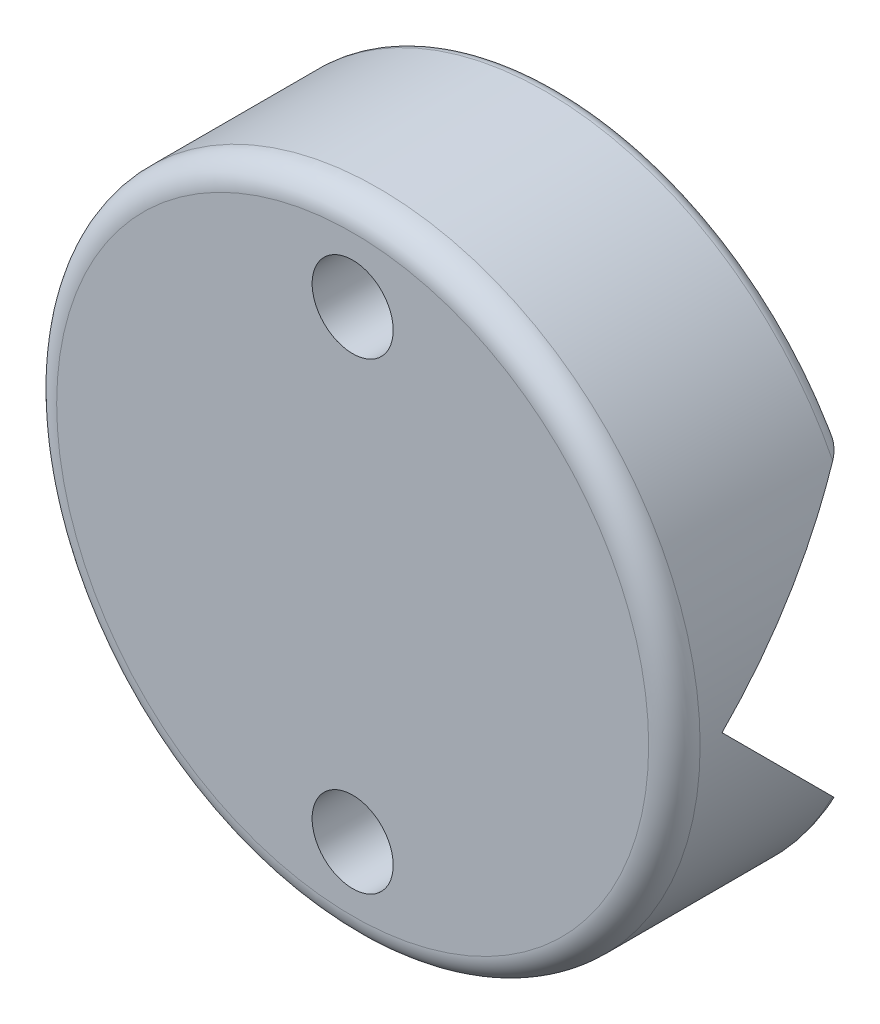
ISO-10303-21;
HEADER;
FILE_DESCRIPTION(('STEP AP214'),'2;1');
FILE_NAME('part.step','',(''),(''),'','','');
FILE_SCHEMA(('AUTOMOTIVE_DESIGN { 1 0 10303 214 1 1 1 1 }'));
ENDSEC;
DATA;
#1=APPLICATION_CONTEXT('core data for automotive mechanical design processes');
#2=APPLICATION_PROTOCOL_DEFINITION('international standard','automotive_design',2000,#1);
#3=PRODUCT_CONTEXT('',#1,'mechanical');
#4=PRODUCT('Part','Part','',(#3));
#5=PRODUCT_RELATED_PRODUCT_CATEGORY('part','',(#4));
#6=PRODUCT_DEFINITION_FORMATION('','',#4);
#7=PRODUCT_DEFINITION_CONTEXT('part definition',#1,'design');
#8=PRODUCT_DEFINITION('design','',#6,#7);
#9=PRODUCT_DEFINITION_SHAPE('','',#8);
#10=(LENGTH_UNIT() NAMED_UNIT(*) SI_UNIT(.MILLI.,.METRE.));
#11=(NAMED_UNIT(*) PLANE_ANGLE_UNIT() SI_UNIT($,.RADIAN.));
#12=(NAMED_UNIT(*) SI_UNIT($,.STERADIAN.) SOLID_ANGLE_UNIT());
#13=UNCERTAINTY_MEASURE_WITH_UNIT(LENGTH_MEASURE(1.E-05),#10,'distance_accuracy_value','');
#14=(GEOMETRIC_REPRESENTATION_CONTEXT(3) GLOBAL_UNCERTAINTY_ASSIGNED_CONTEXT((#13)) GLOBAL_UNIT_ASSIGNED_CONTEXT((#10,
#11,#12)) REPRESENTATION_CONTEXT('',''));
#15=CARTESIAN_POINT('',(0.,0.,0.));
#16=DIRECTION('',(0.,0.,1.));
#17=DIRECTION('',(1.,0.,0.));
#18=AXIS2_PLACEMENT_3D('',#15,#16,#17);
#19=CARTESIAN_POINT('',(0.,0.,0.));
#20=DIRECTION('',(0.,0.,1.));
#21=DIRECTION('',(1.,0.,0.));
#22=AXIS2_PLACEMENT_3D('',#19,#20,#21);
#23=PLANE('',#22);
#24=CARTESIAN_POINT('',(0.,18.,0.));
#25=DIRECTION('',(0.,0.,1.));
#26=DIRECTION('',(1.,0.,0.));
#27=AXIS2_PLACEMENT_3D('',#24,#25,#26);
#28=CIRCLE('',#27,3.15);
#29=CARTESIAN_POINT('',(3.15,18.,0.));
#30=VERTEX_POINT('',#29);
#31=EDGE_CURVE('E113',#30,#30,#28,.T.);
#32=ORIENTED_EDGE('',*,*,#31,.T.);
#33=EDGE_LOOP('',(#32));
#34=FACE_BOUND('',#33,.T.);
#35=DIRECTION('',(-1.,0.,0.));
#36=VECTOR('',#35,1.);
#37=CARTESIAN_POINT('',(0.,12.3,0.));
#38=LINE('',#37,#36);
#39=CARTESIAN_POINT('',(20.6084933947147,12.3,0.));
#40=VERTEX_POINT('',#39);
#41=CARTESIAN_POINT('',(-20.6084933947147,12.3,0.));
#42=VERTEX_POINT('',#41);
#43=EDGE_CURVE('E116',#40,#42,#38,.T.);
#44=ORIENTED_EDGE('',*,*,#43,.T.);
#45=CARTESIAN_POINT('',(0.,0.,0.));
#46=DIRECTION('',(0.,0.,1.));
#47=DIRECTION('',(1.,0.,0.));
#48=AXIS2_PLACEMENT_3D('',#45,#46,#47);
#49=CIRCLE('',#48,24.);
#50=EDGE_CURVE('E233',#42,#40,#49,.F.);
#51=ORIENTED_EDGE('',*,*,#50,.T.);
#52=EDGE_LOOP('',(#44,#51));
#53=FACE_BOUND('',#52,.T.);
#54=ADVANCED_FACE('F33',(#34,#53),#23,.F.);
#55=CARTESIAN_POINT('',(0.,0.,16.));
#56=DIRECTION('',(0.,0.,-1.));
#57=DIRECTION('',(-1.,0.,0.));
#58=AXIS2_PLACEMENT_3D('',#55,#56,#57);
#59=CYLINDRICAL_SURFACE('',#58,25.);
#60=CARTESIAN_POINT('',(0.,0.,14.));
#61=DIRECTION('',(0.,0.,1.));
#62=DIRECTION('',(1.,0.,0.));
#63=AXIS2_PLACEMENT_3D('',#60,#61,#62);
#64=CIRCLE('',#63,25.);
#65=CARTESIAN_POINT('',(25.,0.,14.));
#66=VERTEX_POINT('',#65);
#67=EDGE_CURVE('E124',#66,#66,#64,.F.);
#68=ORIENTED_EDGE('',*,*,#67,.T.);
#69=EDGE_LOOP('',(#68));
#70=FACE_BOUND('',#69,.T.);
#71=CARTESIAN_POINT('',(0.,0.,12.3));
#72=DIRECTION('',(0.,0.707106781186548,0.707106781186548));
#73=DIRECTION('',(0.,0.707106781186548,-0.707106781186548));
#74=AXIS2_PLACEMENT_3D('',#71,#72,#73);
#75=ELLIPSE('',#74,35.3553390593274,25.);
#76=CARTESIAN_POINT('',(25.,0.,12.3));
#77=VERTEX_POINT('',#76);
#78=CARTESIAN_POINT('',(22.3004484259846,11.3,1.));
#79=VERTEX_POINT('',#78);
#80=EDGE_CURVE('E81',#77,#79,#75,.T.);
#81=ORIENTED_EDGE('',*,*,#80,.T.);
#82=CARTESIAN_POINT('',(0.,0.,1.));
#83=DIRECTION('',(0.,0.,1.));
#84=DIRECTION('',(1.,0.,0.));
#85=AXIS2_PLACEMENT_3D('',#82,#83,#84);
#86=CIRCLE('',#85,25.);
#87=CARTESIAN_POINT('',(-22.3004484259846,11.3,1.));
#88=VERTEX_POINT('',#87);
#89=EDGE_CURVE('E128',#79,#88,#86,.T.);
#90=ORIENTED_EDGE('',*,*,#89,.T.);
#91=CARTESIAN_POINT('',(0.,0.,12.3));
#92=DIRECTION('',(0.,0.707106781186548,0.707106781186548));
#93=DIRECTION('',(0.,0.707106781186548,-0.707106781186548));
#94=AXIS2_PLACEMENT_3D('',#91,#92,#93);
#95=ELLIPSE('',#94,35.3553390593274,25.);
#96=CARTESIAN_POINT('',(-25.,0.,12.3));
#97=VERTEX_POINT('',#96);
#98=EDGE_CURVE('E94',#88,#97,#95,.T.);
#99=ORIENTED_EDGE('',*,*,#98,.T.);
#100=CARTESIAN_POINT('',(0.,0.,12.3));
#101=DIRECTION('',(0.,-0.707106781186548,0.707106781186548));
#102=DIRECTION('',(0.,-0.707106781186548,-0.707106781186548));
#103=AXIS2_PLACEMENT_3D('',#100,#101,#102);
#104=ELLIPSE('',#103,35.3553390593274,25.);
#105=CARTESIAN_POINT('',(-22.3004484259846,-11.3,1.));
#106=VERTEX_POINT('',#105);
#107=EDGE_CURVE('E91',#97,#106,#104,.T.);
#108=ORIENTED_EDGE('',*,*,#107,.T.);
#109=CARTESIAN_POINT('',(0.,0.,1.));
#110=DIRECTION('',(0.,0.,1.));
#111=DIRECTION('',(1.,0.,0.));
#112=AXIS2_PLACEMENT_3D('',#109,#110,#111);
#113=CIRCLE('',#112,25.);
#114=CARTESIAN_POINT('',(22.3004484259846,-11.3,1.));
#115=VERTEX_POINT('',#114);
#116=EDGE_CURVE('E85',#106,#115,#113,.T.);
#117=ORIENTED_EDGE('',*,*,#116,.T.);
#118=CARTESIAN_POINT('',(0.,0.,12.3));
#119=DIRECTION('',(0.,-0.707106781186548,0.707106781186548));
#120=DIRECTION('',(0.,-0.707106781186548,-0.707106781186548));
#121=AXIS2_PLACEMENT_3D('',#118,#119,#120);
#122=ELLIPSE('',#121,35.3553390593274,25.);
#123=EDGE_CURVE('E77',#115,#77,#122,.T.);
#124=ORIENTED_EDGE('',*,*,#123,.T.);
#125=EDGE_LOOP('',(#81,#90,#99,#108,#117,#124));
#126=FACE_BOUND('',#125,.T.);
#127=ADVANCED_FACE('F35',(#70,#126),#59,.T.);
#128=CARTESIAN_POINT('',(0.,0.,16.));
#129=DIRECTION('',(0.,0.,1.));
#130=DIRECTION('',(1.,0.,0.));
#131=AXIS2_PLACEMENT_3D('',#128,#129,#130);
#132=PLANE('',#131);
#133=CARTESIAN_POINT('',(0.,0.,16.));
#134=DIRECTION('',(0.,0.,1.));
#135=DIRECTION('',(1.,0.,0.));
#136=AXIS2_PLACEMENT_3D('',#133,#134,#135);
#137=CIRCLE('',#136,23.);
#138=CARTESIAN_POINT('',(23.,0.,16.));
#139=VERTEX_POINT('',#138);
#140=EDGE_CURVE('E121',#139,#139,#137,.T.);
#141=ORIENTED_EDGE('',*,*,#140,.T.);
#142=EDGE_LOOP('',(#141));
#143=FACE_BOUND('',#142,.T.);
#144=CARTESIAN_POINT('',(0.,-18.,16.));
#145=DIRECTION('',(0.,0.,1.));
#146=DIRECTION('',(1.,0.,0.));
#147=AXIS2_PLACEMENT_3D('',#144,#145,#146);
#148=CIRCLE('',#147,3.15);
#149=CARTESIAN_POINT('',(3.15,-18.,16.));
#150=VERTEX_POINT('',#149);
#151=EDGE_CURVE('E104',#150,#150,#148,.T.);
#152=ORIENTED_EDGE('',*,*,#151,.F.);
#153=EDGE_LOOP('',(#152));
#154=FACE_BOUND('',#153,.T.);
#155=CARTESIAN_POINT('',(0.,18.,16.));
#156=DIRECTION('',(0.,0.,1.));
#157=DIRECTION('',(1.,0.,0.));
#158=AXIS2_PLACEMENT_3D('',#155,#156,#157);
#159=CIRCLE('',#158,3.15);
#160=CARTESIAN_POINT('',(3.15,18.,16.));
#161=VERTEX_POINT('',#160);
#162=EDGE_CURVE('E110',#161,#161,#159,.T.);
#163=ORIENTED_EDGE('',*,*,#162,.F.);
#164=EDGE_LOOP('',(#163));
#165=FACE_BOUND('',#164,.T.);
#166=ADVANCED_FACE('F186',(#143,#154,#165),#132,.T.);
#167=DIRECTION('',(1.,0.,0.));
#168=VECTOR('',#167,1.);
#169=CARTESIAN_POINT('',(0.,-12.3,0.));
#170=LINE('',#169,#168);
#171=CARTESIAN_POINT('',(-20.6084933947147,-12.3,0.));
#172=VERTEX_POINT('',#171);
#173=CARTESIAN_POINT('',(20.6084933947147,-12.3,0.));
#174=VERTEX_POINT('',#173);
#175=EDGE_CURVE('E119',#172,#174,#170,.T.);
#176=ORIENTED_EDGE('',*,*,#175,.T.);
#177=CARTESIAN_POINT('',(0.,0.,0.));
#178=DIRECTION('',(0.,0.,1.));
#179=DIRECTION('',(1.,0.,0.));
#180=AXIS2_PLACEMENT_3D('',#177,#178,#179);
#181=CIRCLE('',#180,24.);
#182=EDGE_CURVE('E11',#174,#172,#181,.F.);
#183=ORIENTED_EDGE('',*,*,#182,.T.);
#184=EDGE_LOOP('',(#176,#183));
#185=FACE_BOUND('',#184,.T.);
#186=CARTESIAN_POINT('',(0.,-18.,0.));
#187=DIRECTION('',(0.,0.,1.));
#188=DIRECTION('',(1.,0.,0.));
#189=AXIS2_PLACEMENT_3D('',#186,#187,#188);
#190=CIRCLE('',#189,3.15);
#191=CARTESIAN_POINT('',(3.15,-18.,0.));
#192=VERTEX_POINT('',#191);
#193=EDGE_CURVE('E107',#192,#192,#190,.T.);
#194=ORIENTED_EDGE('',*,*,#193,.T.);
#195=EDGE_LOOP('',(#194));
#196=FACE_BOUND('',#195,.T.);
#197=ADVANCED_FACE('F181',(#185,#196),#23,.F.);
#198=CARTESIAN_POINT('',(0.,18.,0.));
#199=DIRECTION('',(0.,0.,1.));
#200=DIRECTION('',(1.,0.,0.));
#201=AXIS2_PLACEMENT_3D('',#198,#199,#200);
#202=CYLINDRICAL_SURFACE('',#201,3.15);
#203=ORIENTED_EDGE('',*,*,#31,.F.);
#204=EDGE_LOOP('',(#203));
#205=FACE_BOUND('',#204,.T.);
#206=ORIENTED_EDGE('',*,*,#162,.T.);
#207=EDGE_LOOP('',(#206));
#208=FACE_BOUND('',#207,.T.);
#209=ADVANCED_FACE('F190',(#205,#208),#202,.F.);
#210=CARTESIAN_POINT('',(0.,-18.,0.));
#211=DIRECTION('',(0.,0.,1.));
#212=DIRECTION('',(1.,0.,0.));
#213=AXIS2_PLACEMENT_3D('',#210,#211,#212);
#214=CYLINDRICAL_SURFACE('',#213,3.15);
#215=ORIENTED_EDGE('',*,*,#193,.F.);
#216=EDGE_LOOP('',(#215));
#217=FACE_BOUND('',#216,.T.);
#218=ORIENTED_EDGE('',*,*,#151,.T.);
#219=EDGE_LOOP('',(#218));
#220=FACE_BOUND('',#219,.T.);
#221=ADVANCED_FACE('F155',(#217,#220),#214,.F.);
#222=CARTESIAN_POINT('',(-25.,-12.3,0.));
#223=DIRECTION('',(0.,-0.707106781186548,0.707106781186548));
#224=DIRECTION('',(0.,-0.707106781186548,-0.707106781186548));
#225=AXIS2_PLACEMENT_3D('',#222,#223,#224);
#226=PLANE('',#225);
#227=ORIENTED_EDGE('',*,*,#123,.F.);
#228=CARTESIAN_POINT('',(22.3004484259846,-11.3,1.));
#229=CARTESIAN_POINT('',(22.2792794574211,-11.3417313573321,0.958268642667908));
#230=CARTESIAN_POINT('',(22.2554382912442,-11.3827586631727,0.917241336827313));
#231=CARTESIAN_POINT('',(22.2029044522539,-11.4632001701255,0.836799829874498));
#232=CARTESIAN_POINT('',(22.1742150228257,-11.5026154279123,0.797384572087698));
#233=CARTESIAN_POINT('',(22.1123780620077,-11.5797712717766,0.720228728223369));
#234=CARTESIAN_POINT('',(22.0792205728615,-11.6175078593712,0.682492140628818));
#235=CARTESIAN_POINT('',(22.0088472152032,-11.6910286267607,0.608971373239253));
#236=CARTESIAN_POINT('',(21.9716305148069,-11.726812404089,0.573187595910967));
#237=CARTESIAN_POINT('',(21.8524415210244,-11.8326108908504,0.467389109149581));
#238=CARTESIAN_POINT('',(21.7643542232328,-11.8993041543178,0.400695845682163));
#239=CARTESIAN_POINT('',(21.6216625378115,-11.9909746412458,0.309025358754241));
#240=CARTESIAN_POINT('',(21.5723084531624,-12.0201503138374,0.279849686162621));
#241=CARTESIAN_POINT('',(21.4701858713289,-12.0753388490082,0.224661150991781));
#242=CARTESIAN_POINT('',(21.4174189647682,-12.1013531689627,0.198646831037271));
#243=CARTESIAN_POINT('',(21.2944308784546,-12.1560274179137,0.143972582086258));
#244=CARTESIAN_POINT('',(21.2232415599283,-12.1836134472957,0.116386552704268));
#245=CARTESIAN_POINT('',(21.0763898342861,-12.2314047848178,0.0685952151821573));
#246=CARTESIAN_POINT('',(21.0007526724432,-12.2516478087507,0.0483521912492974));
#247=CARTESIAN_POINT('',(20.8721888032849,-12.2773725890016,0.0226274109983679));
#248=CARTESIAN_POINT('',(20.8203561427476,-12.2855354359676,0.0144645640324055));
#249=CARTESIAN_POINT('',(20.7152607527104,-12.2968435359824,0.00315646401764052));
#250=CARTESIAN_POINT('',(20.6619904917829,-12.2999528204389,4.71795611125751E-05));
#251=CARTESIAN_POINT('',(20.6084933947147,-12.3,0.));
#252=B_SPLINE_CURVE_WITH_KNOTS('',3,(#228,#229,#230,#231,#232,#233,#234,#235,#236,#237,#238,
#239,#240,#241,#242,#243,#244,#245,#246,#247,#248,#249,#250,#251),.UNSPECIFIED.,.F.,.F.,(4,2,2,
2,2,2,2,2,2,2,2,4),(0.,0.187979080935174,0.375832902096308,0.564112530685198,0.752430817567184,
1.13761593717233,1.33042077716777,1.52313639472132,1.76601452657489,2.00762688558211,
2.16648978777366,2.3264785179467),.UNSPECIFIED.);
#253=EDGE_CURVE('E41',#115,#174,#252,.T.);
#254=ORIENTED_EDGE('',*,*,#253,.T.);
#255=ORIENTED_EDGE('',*,*,#175,.F.);
#256=CARTESIAN_POINT('',(-20.6084933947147,-12.3,0.));
#257=CARTESIAN_POINT('',(-20.64462855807,-12.299990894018,9.10598200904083E-06));
#258=CARTESIAN_POINT('',(-20.680703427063,-12.298557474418,0.00144252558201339));
#259=CARTESIAN_POINT('',(-20.7523937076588,-12.2931911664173,0.00680883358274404));
#260=CARTESIAN_POINT('',(-20.7880100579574,-12.2892646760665,0.0107353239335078));
#261=CARTESIAN_POINT('',(-20.8931675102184,-12.2743642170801,0.0256357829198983));
#262=CARTESIAN_POINT('',(-20.9618186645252,-12.2602534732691,0.0397465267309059));
#263=CARTESIAN_POINT('',(-21.1238451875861,-12.2182691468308,0.0817308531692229));
#264=CARTESIAN_POINT('',(-21.2154724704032,-12.1871030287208,0.11289697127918));
#265=CARTESIAN_POINT('',(-21.3912765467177,-12.1149583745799,0.185041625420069));
#266=CARTESIAN_POINT('',(-21.4753950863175,-12.0739109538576,0.226089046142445));
#267=CARTESIAN_POINT('',(-21.6599560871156,-11.9700996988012,0.329900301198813));
#268=CARTESIAN_POINT('',(-21.7572772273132,-11.9045588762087,0.395441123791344));
#269=CARTESIAN_POINT('',(-21.935161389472,-11.7633410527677,0.536658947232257));
#270=CARTESIAN_POINT('',(-22.0157741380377,-11.6876952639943,0.612304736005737));
#271=CARTESIAN_POINT('',(-22.1300822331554,-11.5594054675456,0.740594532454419));
#272=CARTESIAN_POINT('',(-22.169767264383,-11.5094013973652,0.790598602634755));
#273=CARTESIAN_POINT('',(-22.2233999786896,-11.4323538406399,0.867646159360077));
#274=CARTESIAN_POINT('',(-22.2402958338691,-11.4063296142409,0.893670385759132));
#275=CARTESIAN_POINT('',(-22.2719868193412,-11.353635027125,0.946364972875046));
#276=CARTESIAN_POINT('',(-22.2867809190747,-11.326964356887,0.973035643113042));
#277=CARTESIAN_POINT('',(-22.3004484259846,-11.3,1.));
#278=B_SPLINE_CURVE_WITH_KNOTS('',3,(#256,#257,#258,#259,#260,#261,#262,#263,#264,#265,#266,
#267,#268,#269,#270,#271,#272,#273,#274,#275,#276,#277),.UNSPECIFIED.,.F.,.F.,(4,2,2,2,2,2,2,2,
2,2,4),(0.,0.108258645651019,0.216240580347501,0.429834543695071,0.733281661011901,
1.03890876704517,1.44011045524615,1.84010039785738,2.08293576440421,2.20436660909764,
2.32585679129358),.UNSPECIFIED.);
#279=EDGE_CURVE('E159',#172,#106,#278,.T.);
#280=ORIENTED_EDGE('',*,*,#279,.T.);
#281=ORIENTED_EDGE('',*,*,#107,.F.);
#282=DIRECTION('',(1.,0.,0.));
#283=VECTOR('',#282,1.);
#284=CARTESIAN_POINT('',(-25.,0.,12.3));
#285=LINE('',#284,#283);
#286=EDGE_CURVE('E89',#97,#77,#285,.T.);
#287=ORIENTED_EDGE('',*,*,#286,.T.);
#288=EDGE_LOOP('',(#227,#254,#255,#280,#281,#287));
#289=FACE_BOUND('',#288,.T.);
#290=ADVANCED_FACE('F90',(#289),#226,.F.);
#291=CARTESIAN_POINT('',(-25.,12.3,0.));
#292=DIRECTION('',(0.,0.707106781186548,0.707106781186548));
#293=DIRECTION('',(0.,-0.707106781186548,0.707106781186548));
#294=AXIS2_PLACEMENT_3D('',#291,#292,#293);
#295=PLANE('',#294);
#296=ORIENTED_EDGE('',*,*,#98,.F.);
#297=CARTESIAN_POINT('',(-22.3004484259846,11.3,1.));
#298=CARTESIAN_POINT('',(-22.2792794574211,11.3417313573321,0.958268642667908));
#299=CARTESIAN_POINT('',(-22.2554382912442,11.3827586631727,0.917241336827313));
#300=CARTESIAN_POINT('',(-22.2029044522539,11.4632001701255,0.836799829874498));
#301=CARTESIAN_POINT('',(-22.1742150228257,11.5026154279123,0.797384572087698));
#302=CARTESIAN_POINT('',(-22.1123780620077,11.5797712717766,0.720228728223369));
#303=CARTESIAN_POINT('',(-22.0792205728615,11.6175078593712,0.682492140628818));
#304=CARTESIAN_POINT('',(-22.0088472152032,11.6910286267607,0.608971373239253));
#305=CARTESIAN_POINT('',(-21.9716305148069,11.726812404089,0.573187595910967));
#306=CARTESIAN_POINT('',(-21.8524415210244,11.8326108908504,0.467389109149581));
#307=CARTESIAN_POINT('',(-21.7643542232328,11.8993041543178,0.400695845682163));
#308=CARTESIAN_POINT('',(-21.6216625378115,11.9909746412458,0.309025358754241));
#309=CARTESIAN_POINT('',(-21.5723084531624,12.0201503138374,0.279849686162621));
#310=CARTESIAN_POINT('',(-21.4701858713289,12.0753388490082,0.224661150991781));
#311=CARTESIAN_POINT('',(-21.4174189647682,12.1013531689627,0.198646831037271));
#312=CARTESIAN_POINT('',(-21.2944308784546,12.1560274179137,0.143972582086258));
#313=CARTESIAN_POINT('',(-21.2232415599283,12.1836134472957,0.116386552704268));
#314=CARTESIAN_POINT('',(-21.0763898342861,12.2314047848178,0.0685952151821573));
#315=CARTESIAN_POINT('',(-21.0007526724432,12.2516478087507,0.0483521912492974));
#316=CARTESIAN_POINT('',(-20.8721888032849,12.2773725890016,0.0226274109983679));
#317=CARTESIAN_POINT('',(-20.8203561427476,12.2855354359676,0.0144645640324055));
#318=CARTESIAN_POINT('',(-20.7152607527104,12.2968435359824,0.00315646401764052));
#319=CARTESIAN_POINT('',(-20.6619904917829,12.2999528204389,4.71795611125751E-05));
#320=CARTESIAN_POINT('',(-20.6084933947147,12.3,0.));
#321=B_SPLINE_CURVE_WITH_KNOTS('',3,(#297,#298,#299,#300,#301,#302,#303,#304,#305,#306,#307,
#308,#309,#310,#311,#312,#313,#314,#315,#316,#317,#318,#319,#320),.UNSPECIFIED.,.F.,.F.,(4,2,2,
2,2,2,2,2,2,2,2,4),(0.,0.187979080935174,0.375832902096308,0.564112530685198,0.752430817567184,
1.13761593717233,1.33042077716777,1.52313639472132,1.76601452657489,2.00762688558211,
2.16648978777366,2.3264785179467),.UNSPECIFIED.);
#322=EDGE_CURVE('E137',#88,#42,#321,.T.);
#323=ORIENTED_EDGE('',*,*,#322,.T.);
#324=ORIENTED_EDGE('',*,*,#43,.F.);
#325=CARTESIAN_POINT('',(20.6084933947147,12.3,0.));
#326=CARTESIAN_POINT('',(20.64462855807,12.299990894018,9.10598200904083E-06));
#327=CARTESIAN_POINT('',(20.680703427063,12.298557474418,0.00144252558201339));
#328=CARTESIAN_POINT('',(20.7523937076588,12.2931911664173,0.00680883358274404));
#329=CARTESIAN_POINT('',(20.7880100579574,12.2892646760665,0.0107353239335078));
#330=CARTESIAN_POINT('',(20.8931675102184,12.2743642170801,0.0256357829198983));
#331=CARTESIAN_POINT('',(20.9618186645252,12.2602534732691,0.0397465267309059));
#332=CARTESIAN_POINT('',(21.1238451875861,12.2182691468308,0.0817308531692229));
#333=CARTESIAN_POINT('',(21.2154724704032,12.1871030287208,0.11289697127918));
#334=CARTESIAN_POINT('',(21.3912765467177,12.1149583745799,0.185041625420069));
#335=CARTESIAN_POINT('',(21.4753950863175,12.0739109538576,0.226089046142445));
#336=CARTESIAN_POINT('',(21.6599560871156,11.9700996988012,0.329900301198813));
#337=CARTESIAN_POINT('',(21.7572772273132,11.9045588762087,0.395441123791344));
#338=CARTESIAN_POINT('',(21.935161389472,11.7633410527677,0.536658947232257));
#339=CARTESIAN_POINT('',(22.0157741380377,11.6876952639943,0.612304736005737));
#340=CARTESIAN_POINT('',(22.1300822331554,11.5594054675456,0.740594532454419));
#341=CARTESIAN_POINT('',(22.169767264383,11.5094013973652,0.790598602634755));
#342=CARTESIAN_POINT('',(22.2233999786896,11.4323538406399,0.867646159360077));
#343=CARTESIAN_POINT('',(22.2402958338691,11.4063296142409,0.893670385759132));
#344=CARTESIAN_POINT('',(22.2719868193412,11.353635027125,0.946364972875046));
#345=CARTESIAN_POINT('',(22.2867809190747,11.326964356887,0.973035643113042));
#346=CARTESIAN_POINT('',(22.3004484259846,11.3,1.));
#347=B_SPLINE_CURVE_WITH_KNOTS('',3,(#325,#326,#327,#328,#329,#330,#331,#332,#333,#334,#335,
#336,#337,#338,#339,#340,#341,#342,#343,#344,#345,#346),.UNSPECIFIED.,.F.,.F.,(4,2,2,2,2,2,2,2,
2,2,4),(0.,0.108258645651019,0.216240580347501,0.429834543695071,0.733281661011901,
1.03890876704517,1.44011045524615,1.84010039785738,2.08293576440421,2.20436660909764,
2.32585679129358),.UNSPECIFIED.);
#348=EDGE_CURVE('E99',#40,#79,#347,.T.);
#349=ORIENTED_EDGE('',*,*,#348,.T.);
#350=ORIENTED_EDGE('',*,*,#80,.F.);
#351=ORIENTED_EDGE('',*,*,#286,.F.);
#352=EDGE_LOOP('',(#296,#323,#324,#349,#350,#351));
#353=FACE_BOUND('',#352,.T.);
#354=ADVANCED_FACE('F96',(#353),#295,.F.);
#355=CARTESIAN_POINT('',(0.,0.,14.));
#356=DIRECTION('',(0.,0.,1.));
#357=DIRECTION('',(1.,0.,0.));
#358=AXIS2_PLACEMENT_3D('',#355,#356,#357);
#359=TOROIDAL_SURFACE('',#358,23.,2.);
#360=ORIENTED_EDGE('',*,*,#67,.F.);
#361=EDGE_LOOP('',(#360));
#362=FACE_BOUND('',#361,.T.);
#363=ORIENTED_EDGE('',*,*,#140,.F.);
#364=EDGE_LOOP('',(#363));
#365=FACE_BOUND('',#364,.T.);
#366=ADVANCED_FACE('F150',(#362,#365),#359,.T.);
#367=CARTESIAN_POINT('',(0.,0.,1.));
#368=DIRECTION('',(0.,0.,1.));
#369=DIRECTION('',(1.,0.,0.));
#370=AXIS2_PLACEMENT_3D('',#367,#368,#369);
#371=TOROIDAL_SURFACE('',#370,24.,1.);
#372=ORIENTED_EDGE('',*,*,#348,.F.);
#373=ORIENTED_EDGE('',*,*,#50,.F.);
#374=ORIENTED_EDGE('',*,*,#322,.F.);
#375=ORIENTED_EDGE('',*,*,#89,.F.);
#376=EDGE_LOOP('',(#372,#373,#374,#375));
#377=FACE_BOUND('',#376,.T.);
#378=ADVANCED_FACE('F143',(#377),#371,.T.);
#379=CARTESIAN_POINT('',(0.,0.,1.));
#380=DIRECTION('',(0.,0.,1.));
#381=DIRECTION('',(1.,0.,0.));
#382=AXIS2_PLACEMENT_3D('',#379,#380,#381);
#383=TOROIDAL_SURFACE('',#382,24.,1.);
#384=ORIENTED_EDGE('',*,*,#279,.F.);
#385=ORIENTED_EDGE('',*,*,#182,.F.);
#386=ORIENTED_EDGE('',*,*,#253,.F.);
#387=ORIENTED_EDGE('',*,*,#116,.F.);
#388=EDGE_LOOP('',(#384,#385,#386,#387));
#389=FACE_BOUND('',#388,.T.);
#390=ADVANCED_FACE('F168',(#389),#383,.T.);
#391=CLOSED_SHELL('',(#54,#127,#166,#197,#209,#221,#290,#354,#366,#378,#390));
#392=MANIFOLD_SOLID_BREP('B2',#391);
#393=ADVANCED_BREP_SHAPE_REPRESENTATION('',(#18,#392),#14);
#394=SHAPE_DEFINITION_REPRESENTATION(#9,#393);
ENDSEC;
END-ISO-10303-21;
